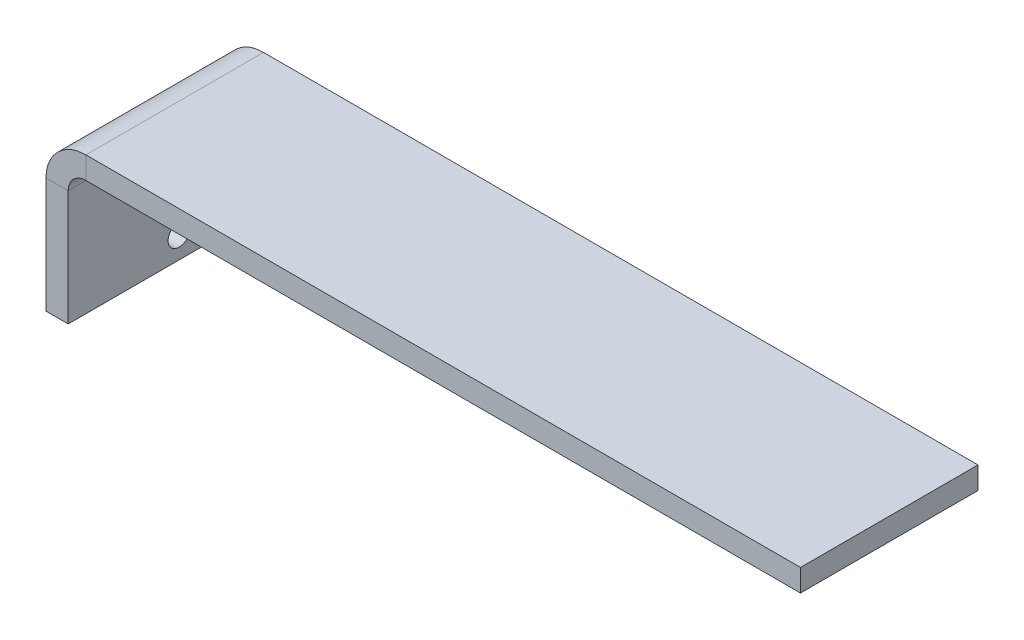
ISO-10303-21;
HEADER;
FILE_DESCRIPTION(('STEP AP214'),'2;1');
FILE_NAME('part.step','',(''),(''),'','','');
FILE_SCHEMA(('AUTOMOTIVE_DESIGN { 1 0 10303 214 1 1 1 1 }'));
ENDSEC;
DATA;
#1=APPLICATION_CONTEXT('core data for automotive mechanical design processes');
#2=APPLICATION_PROTOCOL_DEFINITION('international standard','automotive_design',2000,#1);
#3=PRODUCT_CONTEXT('',#1,'mechanical');
#4=PRODUCT('Part','Part','',(#3));
#5=PRODUCT_RELATED_PRODUCT_CATEGORY('part','',(#4));
#6=PRODUCT_DEFINITION_FORMATION('','',#4);
#7=PRODUCT_DEFINITION_CONTEXT('part definition',#1,'design');
#8=PRODUCT_DEFINITION('design','',#6,#7);
#9=PRODUCT_DEFINITION_SHAPE('','',#8);
#10=(LENGTH_UNIT() NAMED_UNIT(*) SI_UNIT(.MILLI.,.METRE.));
#11=(NAMED_UNIT(*) PLANE_ANGLE_UNIT() SI_UNIT($,.RADIAN.));
#12=(NAMED_UNIT(*) SI_UNIT($,.STERADIAN.) SOLID_ANGLE_UNIT());
#13=UNCERTAINTY_MEASURE_WITH_UNIT(LENGTH_MEASURE(1.E-05),#10,'distance_accuracy_value','');
#14=(GEOMETRIC_REPRESENTATION_CONTEXT(3) GLOBAL_UNCERTAINTY_ASSIGNED_CONTEXT((#13)) GLOBAL_UNIT_ASSIGNED_CONTEXT((#10,
#11,#12)) REPRESENTATION_CONTEXT('',''));
#15=CARTESIAN_POINT('',(0.,0.,0.));
#16=DIRECTION('',(0.,0.,1.));
#17=DIRECTION('',(1.,0.,0.));
#18=AXIS2_PLACEMENT_3D('',#15,#16,#17);
#19=CARTESIAN_POINT('',(9.00000000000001,34.9999999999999,20.));
#20=DIRECTION('',(0.,0.,1.));
#21=DIRECTION('',(1.,0.,0.));
#22=AXIS2_PLACEMENT_3D('',#19,#20,#21);
#23=PLANE('',#22);
#24=DIRECTION('',(0.,-1.,0.));
#25=VECTOR('',#24,1.);
#26=CARTESIAN_POINT('',(9.00000000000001,34.9999999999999,20.));
#27=LINE('',#26,#25);
#28=CARTESIAN_POINT('',(9.00000000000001,34.9999999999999,20.));
#29=VERTEX_POINT('',#28);
#30=CARTESIAN_POINT('',(9.00000000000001,30.,20.));
#31=VERTEX_POINT('',#30);
#32=EDGE_CURVE('E11',#29,#31,#27,.T.);
#33=ORIENTED_EDGE('',*,*,#32,.F.);
#34=CARTESIAN_POINT('',(9.00000000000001,26.,20.));
#35=DIRECTION('',(0.,0.,1.));
#36=DIRECTION('',(1.,0.,0.));
#37=AXIS2_PLACEMENT_3D('',#34,#35,#36);
#38=CIRCLE('',#37,9.);
#39=CARTESIAN_POINT('',(0.,26.,20.));
#40=VERTEX_POINT('',#39);
#41=EDGE_CURVE('E147',#40,#29,#38,.F.);
#42=ORIENTED_EDGE('',*,*,#41,.F.);
#43=DIRECTION('',(-1.,0.,0.));
#44=VECTOR('',#43,1.);
#45=CARTESIAN_POINT('',(5.,26.,20.));
#46=LINE('',#45,#44);
#47=CARTESIAN_POINT('',(5.,26.,20.));
#48=VERTEX_POINT('',#47);
#49=EDGE_CURVE('E52',#48,#40,#46,.T.);
#50=ORIENTED_EDGE('',*,*,#49,.F.);
#51=CARTESIAN_POINT('',(9.00000000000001,26.,20.));
#52=DIRECTION('',(0.,0.,1.));
#53=DIRECTION('',(1.,0.,0.));
#54=AXIS2_PLACEMENT_3D('',#51,#52,#53);
#55=CIRCLE('',#54,4.);
#56=EDGE_CURVE('E136',#48,#31,#55,.F.);
#57=ORIENTED_EDGE('',*,*,#56,.T.);
#58=EDGE_LOOP('',(#33,#42,#50,#57));
#59=FACE_BOUND('',#58,.T.);
#60=ADVANCED_FACE('F42',(#59),#23,.T.);
#61=CARTESIAN_POINT('',(5.,26.,20.));
#62=DIRECTION('',(0.,0.,1.));
#63=DIRECTION('',(1.,0.,0.));
#64=AXIS2_PLACEMENT_3D('',#61,#62,#63);
#65=PLANE('',#64);
#66=DIRECTION('',(1.,0.,0.));
#67=VECTOR('',#66,1.);
#68=CARTESIAN_POINT('',(0.,34.9999999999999,20.));
#69=LINE('',#68,#67);
#70=CARTESIAN_POINT('',(170.,34.9999999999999,20.0000000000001));
#71=VERTEX_POINT('',#70);
#72=EDGE_CURVE('E216',#29,#71,#69,.T.);
#73=ORIENTED_EDGE('',*,*,#72,.F.);
#74=ORIENTED_EDGE('',*,*,#32,.T.);
#75=DIRECTION('',(1.,0.,0.));
#76=VECTOR('',#75,1.);
#77=CARTESIAN_POINT('',(0.,30.,20.));
#78=LINE('',#77,#76);
#79=CARTESIAN_POINT('',(170.,30.,20.0000000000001));
#80=VERTEX_POINT('',#79);
#81=EDGE_CURVE('E100',#31,#80,#78,.T.);
#82=ORIENTED_EDGE('',*,*,#81,.T.);
#83=DIRECTION('',(0.,-1.,0.));
#84=VECTOR('',#83,1.);
#85=CARTESIAN_POINT('',(170.,34.9999999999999,20.0000000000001));
#86=LINE('',#85,#84);
#87=EDGE_CURVE('E431',#71,#80,#86,.T.);
#88=ORIENTED_EDGE('',*,*,#87,.F.);
#89=EDGE_LOOP('',(#73,#74,#82,#88));
#90=FACE_BOUND('',#89,.T.);
#91=ADVANCED_FACE('F224',(#90),#65,.T.);
#92=CARTESIAN_POINT('',(0.,26.,-20.));
#93=DIRECTION('',(0.,0.,-1.));
#94=DIRECTION('',(-1.,0.,0.));
#95=AXIS2_PLACEMENT_3D('',#92,#93,#94);
#96=PLANE('',#95);
#97=DIRECTION('',(1.,0.,0.));
#98=VECTOR('',#97,1.);
#99=CARTESIAN_POINT('',(0.,26.,-20.));
#100=LINE('',#99,#98);
#101=CARTESIAN_POINT('',(0.,26.,-20.));
#102=VERTEX_POINT('',#101);
#103=CARTESIAN_POINT('',(5.,26.,-20.));
#104=VERTEX_POINT('',#103);
#105=EDGE_CURVE('E87',#102,#104,#100,.T.);
#106=ORIENTED_EDGE('',*,*,#105,.F.);
#107=CARTESIAN_POINT('',(9.00000000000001,26.,-20.));
#108=DIRECTION('',(0.,0.,1.));
#109=DIRECTION('',(1.,0.,0.));
#110=AXIS2_PLACEMENT_3D('',#107,#108,#109);
#111=CIRCLE('',#110,9.);
#112=CARTESIAN_POINT('',(9.00000000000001,34.9999999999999,-20.));
#113=VERTEX_POINT('',#112);
#114=EDGE_CURVE('E167',#102,#113,#111,.F.);
#115=ORIENTED_EDGE('',*,*,#114,.T.);
#116=DIRECTION('',(0.,1.,0.));
#117=VECTOR('',#116,1.);
#118=CARTESIAN_POINT('',(9.00000000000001,30.,-20.));
#119=LINE('',#118,#117);
#120=CARTESIAN_POINT('',(9.00000000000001,30.,-20.));
#121=VERTEX_POINT('',#120);
#122=EDGE_CURVE('E94',#121,#113,#119,.T.);
#123=ORIENTED_EDGE('',*,*,#122,.F.);
#124=CARTESIAN_POINT('',(9.00000000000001,26.,-20.));
#125=DIRECTION('',(0.,0.,1.));
#126=DIRECTION('',(1.,0.,0.));
#127=AXIS2_PLACEMENT_3D('',#124,#125,#126);
#128=CIRCLE('',#127,4.);
#129=EDGE_CURVE('E178',#104,#121,#128,.F.);
#130=ORIENTED_EDGE('',*,*,#129,.F.);
#131=EDGE_LOOP('',(#106,#115,#123,#130));
#132=FACE_BOUND('',#131,.T.);
#133=ADVANCED_FACE('F222',(#132),#96,.T.);
#134=CARTESIAN_POINT('',(9.00000000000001,30.,-20.));
#135=DIRECTION('',(0.,0.,-1.));
#136=DIRECTION('',(-1.,0.,0.));
#137=AXIS2_PLACEMENT_3D('',#134,#135,#136);
#138=PLANE('',#137);
#139=DIRECTION('',(0.,1.,0.));
#140=VECTOR('',#139,1.);
#141=CARTESIAN_POINT('',(0.,0.,-20.));
#142=LINE('',#141,#140);
#143=CARTESIAN_POINT('',(0.,0.,-20.));
#144=VERTEX_POINT('',#143);
#145=EDGE_CURVE('E170',#144,#102,#142,.T.);
#146=ORIENTED_EDGE('',*,*,#145,.T.);
#147=ORIENTED_EDGE('',*,*,#105,.T.);
#148=DIRECTION('',(0.,1.,0.));
#149=VECTOR('',#148,1.);
#150=CARTESIAN_POINT('',(5.,0.,-20.));
#151=LINE('',#150,#149);
#152=CARTESIAN_POINT('',(5.,0.,-20.));
#153=VERTEX_POINT('',#152);
#154=EDGE_CURVE('E175',#153,#104,#151,.T.);
#155=ORIENTED_EDGE('',*,*,#154,.F.);
#156=DIRECTION('',(-1.,0.,0.));
#157=VECTOR('',#156,1.);
#158=CARTESIAN_POINT('',(5.,0.,-20.));
#159=LINE('',#158,#157);
#160=EDGE_CURVE('E122',#153,#144,#159,.T.);
#161=ORIENTED_EDGE('',*,*,#160,.T.);
#162=EDGE_LOOP('',(#146,#147,#155,#161));
#163=FACE_BOUND('',#162,.T.);
#164=ADVANCED_FACE('F218',(#163),#138,.T.);
#165=CARTESIAN_POINT('',(0.,30.,20.));
#166=DIRECTION('',(0.,1.,0.));
#167=DIRECTION('',(0.,0.,1.));
#168=AXIS2_PLACEMENT_3D('',#165,#166,#167);
#169=PLANE('',#168);
#170=DIRECTION('',(1.,0.,0.));
#171=VECTOR('',#170,1.);
#172=CARTESIAN_POINT('',(0.,30.,-20.));
#173=LINE('',#172,#171);
#174=CARTESIAN_POINT('',(170.,30.,-20.));
#175=VERTEX_POINT('',#174);
#176=EDGE_CURVE('E154',#121,#175,#173,.T.);
#177=ORIENTED_EDGE('',*,*,#176,.T.);
#178=DIRECTION('',(0.,0.,-1.));
#179=VECTOR('',#178,1.);
#180=CARTESIAN_POINT('',(170.,30.,20.0000000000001));
#181=LINE('',#180,#179);
#182=EDGE_CURVE('E198',#80,#175,#181,.T.);
#183=ORIENTED_EDGE('',*,*,#182,.F.);
#184=ORIENTED_EDGE('',*,*,#81,.F.);
#185=DIRECTION('',(0.,0.,-1.));
#186=VECTOR('',#185,1.);
#187=CARTESIAN_POINT('',(9.00000000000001,30.,20.));
#188=LINE('',#187,#186);
#189=EDGE_CURVE('E153',#31,#121,#188,.T.);
#190=ORIENTED_EDGE('',*,*,#189,.T.);
#191=EDGE_LOOP('',(#177,#183,#184,#190));
#192=FACE_BOUND('',#191,.T.);
#193=ADVANCED_FACE('F230',(#192),#169,.F.);
#194=CARTESIAN_POINT('',(170.,34.9999999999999,20.0000000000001));
#195=DIRECTION('',(1.,0.,0.));
#196=DIRECTION('',(0.,0.,-1.));
#197=AXIS2_PLACEMENT_3D('',#194,#195,#196);
#198=PLANE('',#197);
#199=DIRECTION('',(0.,-1.,0.));
#200=VECTOR('',#199,1.);
#201=CARTESIAN_POINT('',(170.,34.9999999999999,-20.));
#202=LINE('',#201,#200);
#203=CARTESIAN_POINT('',(170.,34.9999999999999,-20.));
#204=VERTEX_POINT('',#203);
#205=EDGE_CURVE('E158',#204,#175,#202,.T.);
#206=ORIENTED_EDGE('',*,*,#205,.F.);
#207=DIRECTION('',(0.,0.,-1.));
#208=VECTOR('',#207,1.);
#209=CARTESIAN_POINT('',(170.,34.9999999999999,20.0000000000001));
#210=LINE('',#209,#208);
#211=EDGE_CURVE('E196',#71,#204,#210,.T.);
#212=ORIENTED_EDGE('',*,*,#211,.F.);
#213=ORIENTED_EDGE('',*,*,#87,.T.);
#214=ORIENTED_EDGE('',*,*,#182,.T.);
#215=EDGE_LOOP('',(#206,#212,#213,#214));
#216=FACE_BOUND('',#215,.T.);
#217=ADVANCED_FACE('F255',(#216),#198,.T.);
#218=CARTESIAN_POINT('',(0.,34.9999999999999,20.));
#219=DIRECTION('',(0.,1.,0.));
#220=DIRECTION('',(0.,0.,1.));
#221=AXIS2_PLACEMENT_3D('',#218,#219,#220);
#222=PLANE('',#221);
#223=DIRECTION('',(1.,0.,0.));
#224=VECTOR('',#223,1.);
#225=CARTESIAN_POINT('',(0.,34.9999999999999,-20.));
#226=LINE('',#225,#224);
#227=EDGE_CURVE('E163',#113,#204,#226,.T.);
#228=ORIENTED_EDGE('',*,*,#227,.F.);
#229=DIRECTION('',(0.,0.,-1.));
#230=VECTOR('',#229,1.);
#231=CARTESIAN_POINT('',(9.00000000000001,34.9999999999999,20.));
#232=LINE('',#231,#230);
#233=EDGE_CURVE('E192',#29,#113,#232,.T.);
#234=ORIENTED_EDGE('',*,*,#233,.F.);
#235=ORIENTED_EDGE('',*,*,#72,.T.);
#236=ORIENTED_EDGE('',*,*,#211,.T.);
#237=EDGE_LOOP('',(#228,#234,#235,#236));
#238=FACE_BOUND('',#237,.T.);
#239=ADVANCED_FACE('F264',(#238),#222,.T.);
#240=CARTESIAN_POINT('',(9.00000000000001,26.,20.));
#241=DIRECTION('',(0.,0.,-1.));
#242=DIRECTION('',(-1.,0.,0.));
#243=AXIS2_PLACEMENT_3D('',#240,#241,#242);
#244=CYLINDRICAL_SURFACE('',#243,9.);
#245=ORIENTED_EDGE('',*,*,#114,.F.);
#246=DIRECTION('',(0.,0.,-1.));
#247=VECTOR('',#246,1.);
#248=CARTESIAN_POINT('',(0.,26.,20.));
#249=LINE('',#248,#247);
#250=EDGE_CURVE('E188',#40,#102,#249,.T.);
#251=ORIENTED_EDGE('',*,*,#250,.F.);
#252=ORIENTED_EDGE('',*,*,#41,.T.);
#253=ORIENTED_EDGE('',*,*,#233,.T.);
#254=EDGE_LOOP('',(#245,#251,#252,#253));
#255=FACE_BOUND('',#254,.T.);
#256=ADVANCED_FACE('F212',(#255),#244,.T.);
#257=CARTESIAN_POINT('',(0.,0.,20.));
#258=DIRECTION('',(-1.,0.,0.));
#259=DIRECTION('',(0.,0.,1.));
#260=AXIS2_PLACEMENT_3D('',#257,#258,#259);
#261=PLANE('',#260);
#262=CARTESIAN_POINT('',(0.,4.99999999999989,-5.));
#263=DIRECTION('',(-1.,0.,0.));
#264=DIRECTION('',(0.,0.,1.));
#265=AXIS2_PLACEMENT_3D('',#262,#263,#264);
#266=CIRCLE('',#265,2.49999999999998);
#267=CARTESIAN_POINT('',(0.,4.99999999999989,-2.50000000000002));
#268=VERTEX_POINT('',#267);
#269=EDGE_CURVE('E415',#268,#268,#266,.T.);
#270=ORIENTED_EDGE('',*,*,#269,.F.);
#271=EDGE_LOOP('',(#270));
#272=FACE_BOUND('',#271,.T.);
#273=CARTESIAN_POINT('',(0.,18.9999999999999,5.));
#274=DIRECTION('',(-1.,0.,0.));
#275=DIRECTION('',(0.,0.,1.));
#276=AXIS2_PLACEMENT_3D('',#273,#274,#275);
#277=CIRCLE('',#276,2.49999999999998);
#278=CARTESIAN_POINT('',(0.,18.9999999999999,7.49999999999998));
#279=VERTEX_POINT('',#278);
#280=EDGE_CURVE('E419',#279,#279,#277,.T.);
#281=ORIENTED_EDGE('',*,*,#280,.F.);
#282=EDGE_LOOP('',(#281));
#283=FACE_BOUND('',#282,.T.);
#284=ORIENTED_EDGE('',*,*,#145,.F.);
#285=DIRECTION('',(0.,0.,-1.));
#286=VECTOR('',#285,1.);
#287=CARTESIAN_POINT('',(0.,0.,20.));
#288=LINE('',#287,#286);
#289=CARTESIAN_POINT('',(0.,0.,20.));
#290=VERTEX_POINT('',#289);
#291=EDGE_CURVE('E125',#290,#144,#288,.T.);
#292=ORIENTED_EDGE('',*,*,#291,.F.);
#293=DIRECTION('',(0.,1.,0.));
#294=VECTOR('',#293,1.);
#295=CARTESIAN_POINT('',(0.,0.,20.));
#296=LINE('',#295,#294);
#297=EDGE_CURVE('E141',#290,#40,#296,.T.);
#298=ORIENTED_EDGE('',*,*,#297,.T.);
#299=ORIENTED_EDGE('',*,*,#250,.T.);
#300=EDGE_LOOP('',(#284,#292,#298,#299));
#301=FACE_BOUND('',#300,.T.);
#302=ADVANCED_FACE('F217',(#272,#283,#301),#261,.T.);
#303=CARTESIAN_POINT('',(5.,0.,20.));
#304=DIRECTION('',(0.,-1.,0.));
#305=DIRECTION('',(0.,0.,-1.));
#306=AXIS2_PLACEMENT_3D('',#303,#304,#305);
#307=PLANE('',#306);
#308=ORIENTED_EDGE('',*,*,#160,.F.);
#309=DIRECTION('',(0.,0.,-1.));
#310=VECTOR('',#309,1.);
#311=CARTESIAN_POINT('',(5.,0.,20.));
#312=LINE('',#311,#310);
#313=CARTESIAN_POINT('',(5.,0.,20.));
#314=VERTEX_POINT('',#313);
#315=EDGE_CURVE('E116',#314,#153,#312,.T.);
#316=ORIENTED_EDGE('',*,*,#315,.F.);
#317=DIRECTION('',(-1.,0.,0.));
#318=VECTOR('',#317,1.);
#319=CARTESIAN_POINT('',(5.,0.,20.));
#320=LINE('',#319,#318);
#321=EDGE_CURVE('E120',#314,#290,#320,.T.);
#322=ORIENTED_EDGE('',*,*,#321,.T.);
#323=ORIENTED_EDGE('',*,*,#291,.T.);
#324=EDGE_LOOP('',(#308,#316,#322,#323));
#325=FACE_BOUND('',#324,.T.);
#326=ADVANCED_FACE('F118',(#325),#307,.T.);
#327=CARTESIAN_POINT('',(5.,0.,20.));
#328=DIRECTION('',(-1.,0.,0.));
#329=DIRECTION('',(0.,0.,1.));
#330=AXIS2_PLACEMENT_3D('',#327,#328,#329);
#331=PLANE('',#330);
#332=CARTESIAN_POINT('',(5.,4.99999999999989,-5.));
#333=DIRECTION('',(-1.,0.,0.));
#334=DIRECTION('',(0.,0.,1.));
#335=AXIS2_PLACEMENT_3D('',#332,#333,#334);
#336=CIRCLE('',#335,2.49999999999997);
#337=CARTESIAN_POINT('',(5.,4.99999999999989,-2.50000000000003));
#338=VERTEX_POINT('',#337);
#339=EDGE_CURVE('E45',#338,#338,#336,.T.);
#340=ORIENTED_EDGE('',*,*,#339,.T.);
#341=EDGE_LOOP('',(#340));
#342=FACE_BOUND('',#341,.T.);
#343=CARTESIAN_POINT('',(5.,18.9999999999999,5.));
#344=DIRECTION('',(-1.,0.,0.));
#345=DIRECTION('',(0.,0.,1.));
#346=AXIS2_PLACEMENT_3D('',#343,#344,#345);
#347=CIRCLE('',#346,2.49999999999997);
#348=CARTESIAN_POINT('',(5.,18.9999999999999,7.49999999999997));
#349=VERTEX_POINT('',#348);
#350=EDGE_CURVE('E159',#349,#349,#347,.T.);
#351=ORIENTED_EDGE('',*,*,#350,.T.);
#352=EDGE_LOOP('',(#351));
#353=FACE_BOUND('',#352,.T.);
#354=ORIENTED_EDGE('',*,*,#154,.T.);
#355=DIRECTION('',(0.,0.,-1.));
#356=VECTOR('',#355,1.);
#357=CARTESIAN_POINT('',(5.,26.,20.));
#358=LINE('',#357,#356);
#359=EDGE_CURVE('E126',#48,#104,#358,.T.);
#360=ORIENTED_EDGE('',*,*,#359,.F.);
#361=DIRECTION('',(0.,1.,0.));
#362=VECTOR('',#361,1.);
#363=CARTESIAN_POINT('',(5.,0.,20.));
#364=LINE('',#363,#362);
#365=EDGE_CURVE('E130',#314,#48,#364,.T.);
#366=ORIENTED_EDGE('',*,*,#365,.F.);
#367=ORIENTED_EDGE('',*,*,#315,.T.);
#368=EDGE_LOOP('',(#354,#360,#366,#367));
#369=FACE_BOUND('',#368,.T.);
#370=ADVANCED_FACE('F131',(#342,#353,#369),#331,.F.);
#371=CARTESIAN_POINT('',(9.00000000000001,26.,20.));
#372=DIRECTION('',(0.,0.,-1.));
#373=DIRECTION('',(-1.,0.,0.));
#374=AXIS2_PLACEMENT_3D('',#371,#372,#373);
#375=CYLINDRICAL_SURFACE('',#374,4.);
#376=ORIENTED_EDGE('',*,*,#129,.T.);
#377=ORIENTED_EDGE('',*,*,#189,.F.);
#378=ORIENTED_EDGE('',*,*,#56,.F.);
#379=ORIENTED_EDGE('',*,*,#359,.T.);
#380=EDGE_LOOP('',(#376,#377,#378,#379));
#381=FACE_BOUND('',#380,.T.);
#382=ADVANCED_FACE('F220',(#381),#375,.F.);
#383=CARTESIAN_POINT('',(9.00000000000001,26.,20.));
#384=DIRECTION('',(0.,0.,1.));
#385=DIRECTION('',(1.,0.,0.));
#386=AXIS2_PLACEMENT_3D('',#383,#384,#385);
#387=PLANE('',#386);
#388=ORIENTED_EDGE('',*,*,#365,.T.);
#389=ORIENTED_EDGE('',*,*,#49,.T.);
#390=ORIENTED_EDGE('',*,*,#297,.F.);
#391=ORIENTED_EDGE('',*,*,#321,.F.);
#392=EDGE_LOOP('',(#388,#389,#390,#391));
#393=FACE_BOUND('',#392,.T.);
#394=ADVANCED_FACE('F139',(#393),#387,.T.);
#395=CARTESIAN_POINT('',(9.00000000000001,26.,-20.));
#396=DIRECTION('',(0.,0.,1.));
#397=DIRECTION('',(1.,0.,0.));
#398=AXIS2_PLACEMENT_3D('',#395,#396,#397);
#399=PLANE('',#398);
#400=ORIENTED_EDGE('',*,*,#176,.F.);
#401=ORIENTED_EDGE('',*,*,#122,.T.);
#402=ORIENTED_EDGE('',*,*,#227,.T.);
#403=ORIENTED_EDGE('',*,*,#205,.T.);
#404=EDGE_LOOP('',(#400,#401,#402,#403));
#405=FACE_BOUND('',#404,.T.);
#406=ADVANCED_FACE('F318',(#405),#399,.F.);
#407=CARTESIAN_POINT('',(0.,18.9999999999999,5.));
#408=DIRECTION('',(-1.,0.,0.));
#409=DIRECTION('',(0.,0.,1.));
#410=AXIS2_PLACEMENT_3D('',#407,#408,#409);
#411=CYLINDRICAL_SURFACE('',#410,2.49999999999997);
#412=ORIENTED_EDGE('',*,*,#280,.T.);
#413=EDGE_LOOP('',(#412));
#414=FACE_BOUND('',#413,.T.);
#415=ORIENTED_EDGE('',*,*,#350,.F.);
#416=EDGE_LOOP('',(#415));
#417=FACE_BOUND('',#416,.T.);
#418=ADVANCED_FACE('F326',(#414,#417),#411,.F.);
#419=CARTESIAN_POINT('',(0.,4.99999999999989,-5.));
#420=DIRECTION('',(-1.,0.,0.));
#421=DIRECTION('',(0.,0.,1.));
#422=AXIS2_PLACEMENT_3D('',#419,#420,#421);
#423=CYLINDRICAL_SURFACE('',#422,2.49999999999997);
#424=ORIENTED_EDGE('',*,*,#269,.T.);
#425=EDGE_LOOP('',(#424));
#426=FACE_BOUND('',#425,.T.);
#427=ORIENTED_EDGE('',*,*,#339,.F.);
#428=EDGE_LOOP('',(#427));
#429=FACE_BOUND('',#428,.T.);
#430=ADVANCED_FACE('F336',(#426,#429),#423,.F.);
#431=CLOSED_SHELL('',(#60,#91,#133,#164,#193,#217,#239,#256,#302,#326,#370,#382,#394,#406,#418,#430));
#432=MANIFOLD_SOLID_BREP('B2',#431);
#433=ADVANCED_BREP_SHAPE_REPRESENTATION('',(#18,#432),#14);
#434=SHAPE_DEFINITION_REPRESENTATION(#9,#433);
ENDSEC;
END-ISO-10303-21;
